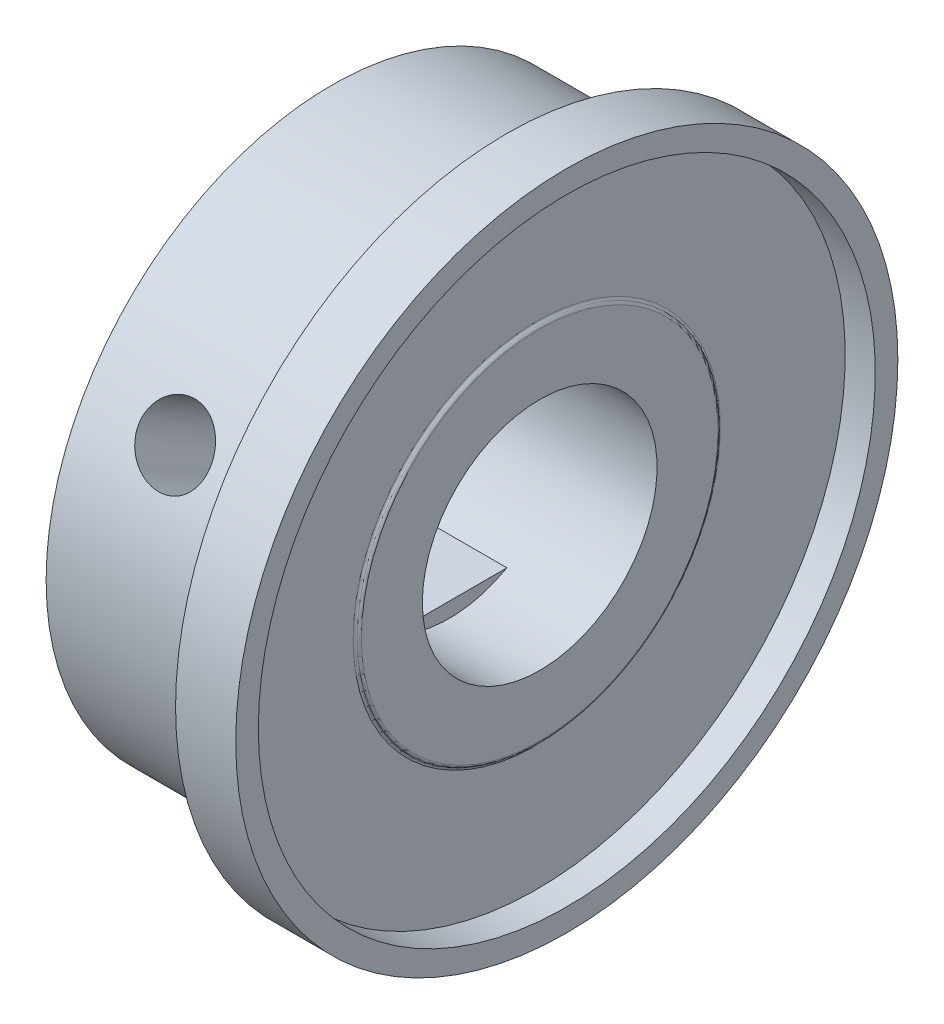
ISO-10303-21;
HEADER;
FILE_DESCRIPTION(('STEP AP214'),'2;1');
FILE_NAME('part.step','',(''),(''),'','','');
FILE_SCHEMA(('AUTOMOTIVE_DESIGN { 1 0 10303 214 1 1 1 1 }'));
ENDSEC;
DATA;
#1=APPLICATION_CONTEXT('core data for automotive mechanical design processes');
#2=APPLICATION_PROTOCOL_DEFINITION('international standard','automotive_design',2000,#1);
#3=PRODUCT_CONTEXT('',#1,'mechanical');
#4=PRODUCT('Part','Part','',(#3));
#5=PRODUCT_RELATED_PRODUCT_CATEGORY('part','',(#4));
#6=PRODUCT_DEFINITION_FORMATION('','',#4);
#7=PRODUCT_DEFINITION_CONTEXT('part definition',#1,'design');
#8=PRODUCT_DEFINITION('design','',#6,#7);
#9=PRODUCT_DEFINITION_SHAPE('','',#8);
#10=(LENGTH_UNIT() NAMED_UNIT(*) SI_UNIT(.MILLI.,.METRE.));
#11=(NAMED_UNIT(*) PLANE_ANGLE_UNIT() SI_UNIT($,.RADIAN.));
#12=(NAMED_UNIT(*) SI_UNIT($,.STERADIAN.) SOLID_ANGLE_UNIT());
#13=UNCERTAINTY_MEASURE_WITH_UNIT(LENGTH_MEASURE(1.E-05),#10,'distance_accuracy_value','');
#14=(GEOMETRIC_REPRESENTATION_CONTEXT(3) GLOBAL_UNCERTAINTY_ASSIGNED_CONTEXT((#13)) GLOBAL_UNIT_ASSIGNED_CONTEXT((#10,
#11,#12)) REPRESENTATION_CONTEXT('',''));
#15=CARTESIAN_POINT('',(0.,0.,0.));
#16=DIRECTION('',(0.,0.,1.));
#17=DIRECTION('',(1.,0.,0.));
#18=AXIS2_PLACEMENT_3D('',#15,#16,#17);
#19=CARTESIAN_POINT('',(-3.56436782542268,0.,0.));
#20=DIRECTION('',(-1.,0.,0.));
#21=DIRECTION('',(0.,0.,1.));
#22=AXIS2_PLACEMENT_3D('',#19,#20,#21);
#23=CYLINDRICAL_SURFACE('',#22,3.9);
#24=CARTESIAN_POINT('',(6.9,0.,0.));
#25=DIRECTION('',(-1.,0.,0.));
#26=DIRECTION('',(0.,0.,1.));
#27=AXIS2_PLACEMENT_3D('',#24,#25,#26);
#28=CIRCLE('',#27,3.9);
#29=CARTESIAN_POINT('',(6.9,0.,3.9));
#30=VERTEX_POINT('',#29);
#31=EDGE_CURVE('E418',#30,#30,#28,.T.);
#32=ORIENTED_EDGE('',*,*,#31,.F.);
#33=EDGE_LOOP('',(#32));
#34=FACE_BOUND('',#33,.T.);
#35=CARTESIAN_POINT('',(0.4,0.,0.));
#36=DIRECTION('',(-1.,0.,0.));
#37=DIRECTION('',(0.,0.,1.));
#38=AXIS2_PLACEMENT_3D('',#35,#36,#37);
#39=CIRCLE('',#38,3.9);
#40=CARTESIAN_POINT('',(0.4,-3.4,-1.91049731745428));
#41=VERTEX_POINT('',#40);
#42=CARTESIAN_POINT('',(0.4,3.4,-1.91049731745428));
#43=VERTEX_POINT('',#42);
#44=EDGE_CURVE('E365',#41,#43,#39,.F.);
#45=ORIENTED_EDGE('',*,*,#44,.F.);
#46=DIRECTION('',(-1.,0.,0.));
#47=VECTOR('',#46,1.);
#48=CARTESIAN_POINT('',(7.8,-3.4,-1.91049731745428));
#49=LINE('',#48,#47);
#50=CARTESIAN_POINT('',(3.9,-3.4,-1.91049731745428));
#51=VERTEX_POINT('',#50);
#52=EDGE_CURVE('E411',#51,#41,#49,.T.);
#53=ORIENTED_EDGE('',*,*,#52,.F.);
#54=CARTESIAN_POINT('',(3.9,0.,0.));
#55=DIRECTION('',(-1.,0.,0.));
#56=DIRECTION('',(0.,0.,1.));
#57=AXIS2_PLACEMENT_3D('',#54,#55,#56);
#58=CIRCLE('',#57,3.9);
#59=CARTESIAN_POINT('',(3.9,-3.4,1.91049731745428));
#60=VERTEX_POINT('',#59);
#61=EDGE_CURVE('E419',#51,#60,#58,.T.);
#62=ORIENTED_EDGE('',*,*,#61,.T.);
#63=DIRECTION('',(-1.,0.,0.));
#64=VECTOR('',#63,1.);
#65=CARTESIAN_POINT('',(7.8,-3.4,1.91049731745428));
#66=LINE('',#65,#64);
#67=CARTESIAN_POINT('',(0.4,-3.4,1.91049731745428));
#68=VERTEX_POINT('',#67);
#69=EDGE_CURVE('E404',#60,#68,#66,.T.);
#70=ORIENTED_EDGE('',*,*,#69,.T.);
#71=CARTESIAN_POINT('',(0.4,3.4,1.91049731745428));
#72=VERTEX_POINT('',#71);
#73=EDGE_CURVE('E391',#72,#68,#39,.F.);
#74=ORIENTED_EDGE('',*,*,#73,.F.);
#75=DIRECTION('',(-1.,0.,0.));
#76=VECTOR('',#75,1.);
#77=CARTESIAN_POINT('',(7.8,3.4,1.91049731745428));
#78=LINE('',#77,#76);
#79=CARTESIAN_POINT('',(3.9,3.4,1.91049731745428));
#80=VERTEX_POINT('',#79);
#81=EDGE_CURVE('E401',#80,#72,#78,.T.);
#82=ORIENTED_EDGE('',*,*,#81,.F.);
#83=CARTESIAN_POINT('',(3.9,3.4,-1.91049731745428));
#84=VERTEX_POINT('',#83);
#85=EDGE_CURVE('E416',#80,#84,#58,.T.);
#86=ORIENTED_EDGE('',*,*,#85,.T.);
#87=DIRECTION('',(-1.,0.,0.));
#88=VECTOR('',#87,1.);
#89=CARTESIAN_POINT('',(7.8,3.4,-1.91049731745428));
#90=LINE('',#89,#88);
#91=EDGE_CURVE('E372',#84,#43,#90,.T.);
#92=ORIENTED_EDGE('',*,*,#91,.T.);
#93=EDGE_LOOP('',(#45,#53,#62,#70,#74,#82,#86,#92));
#94=FACE_BOUND('',#93,.T.);
#95=ADVANCED_FACE('F350',(#34,#94),#23,.F.);
#96=CARTESIAN_POINT('',(7.8,-3.4,-1.91049731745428));
#97=DIRECTION('',(0.,-1.,0.));
#98=DIRECTION('',(0.,0.,-1.));
#99=AXIS2_PLACEMENT_3D('',#96,#97,#98);
#100=PLANE('',#99);
#101=DIRECTION('',(0.,0.,-1.));
#102=VECTOR('',#101,1.);
#103=CARTESIAN_POINT('',(0.4,-3.4,-1.91049731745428));
#104=LINE('',#103,#102);
#105=EDGE_CURVE('E409',#68,#41,#104,.T.);
#106=ORIENTED_EDGE('',*,*,#105,.F.);
#107=ORIENTED_EDGE('',*,*,#69,.F.);
#108=DIRECTION('',(0.,0.,1.));
#109=VECTOR('',#108,1.);
#110=CARTESIAN_POINT('',(3.9,-3.4,0.));
#111=LINE('',#110,#109);
#112=EDGE_CURVE('E395',#51,#60,#111,.T.);
#113=ORIENTED_EDGE('',*,*,#112,.F.);
#114=ORIENTED_EDGE('',*,*,#52,.T.);
#115=EDGE_LOOP('',(#106,#107,#113,#114));
#116=FACE_BOUND('',#115,.T.);
#117=ADVANCED_FACE('F470',(#116),#100,.F.);
#118=CARTESIAN_POINT('',(7.8,3.4,-1.91049731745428));
#119=DIRECTION('',(0.,1.,0.));
#120=DIRECTION('',(0.,0.,1.));
#121=AXIS2_PLACEMENT_3D('',#118,#119,#120);
#122=PLANE('',#121);
#123=DIRECTION('',(0.,0.,1.));
#124=VECTOR('',#123,1.);
#125=CARTESIAN_POINT('',(0.4,3.4,-1.91049731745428));
#126=LINE('',#125,#124);
#127=EDGE_CURVE('E388',#43,#72,#126,.T.);
#128=ORIENTED_EDGE('',*,*,#127,.F.);
#129=ORIENTED_EDGE('',*,*,#91,.F.);
#130=DIRECTION('',(0.,0.,-1.));
#131=VECTOR('',#130,1.);
#132=CARTESIAN_POINT('',(3.9,3.4,0.));
#133=LINE('',#132,#131);
#134=EDGE_CURVE('E408',#80,#84,#133,.T.);
#135=ORIENTED_EDGE('',*,*,#134,.F.);
#136=ORIENTED_EDGE('',*,*,#81,.T.);
#137=EDGE_LOOP('',(#128,#129,#135,#136));
#138=FACE_BOUND('',#137,.T.);
#139=ADVANCED_FACE('F407',(#138),#122,.F.);
#140=CARTESIAN_POINT('',(3.9,3.9,0.));
#141=DIRECTION('',(-1.,0.,0.));
#142=DIRECTION('',(0.,0.,1.));
#143=AXIS2_PLACEMENT_3D('',#140,#141,#142);
#144=PLANE('',#143);
#145=ORIENTED_EDGE('',*,*,#61,.F.);
#146=ORIENTED_EDGE('',*,*,#112,.T.);
#147=EDGE_LOOP('',(#145,#146));
#148=FACE_BOUND('',#147,.T.);
#149=ADVANCED_FACE('F476',(#148),#144,.F.);
#150=CARTESIAN_POINT('',(0.,0.,0.));
#151=DIRECTION('',(1.,0.,0.));
#152=DIRECTION('',(0.,0.,-1.));
#153=AXIS2_PLACEMENT_3D('',#150,#151,#152);
#154=PLANE('',#153);
#155=CARTESIAN_POINT('',(0.,0.,0.));
#156=DIRECTION('',(-1.,0.,0.));
#157=DIRECTION('',(0.,0.,1.));
#158=AXIS2_PLACEMENT_3D('',#155,#156,#157);
#159=CIRCLE('',#158,5.);
#160=CARTESIAN_POINT('',(0.,0.,5.));
#161=VERTEX_POINT('',#160);
#162=EDGE_CURVE('E449',#161,#161,#159,.T.);
#163=ORIENTED_EDGE('',*,*,#162,.F.);
#164=EDGE_LOOP('',(#163));
#165=FACE_BOUND('',#164,.T.);
#166=CARTESIAN_POINT('',(0.,0.,0.));
#167=DIRECTION('',(-1.,0.,0.));
#168=DIRECTION('',(0.,0.,1.));
#169=AXIS2_PLACEMENT_3D('',#166,#167,#168);
#170=CIRCLE('',#169,9.5);
#171=CARTESIAN_POINT('',(0.,0.,9.5));
#172=VERTEX_POINT('',#171);
#173=EDGE_CURVE('E437',#172,#172,#170,.T.);
#174=ORIENTED_EDGE('',*,*,#173,.T.);
#175=EDGE_LOOP('',(#174));
#176=FACE_BOUND('',#175,.T.);
#177=ADVANCED_FACE('F352',(#165,#176),#154,.F.);
#178=CARTESIAN_POINT('',(-3.56436782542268,0.,0.));
#179=DIRECTION('',(-1.,0.,0.));
#180=DIRECTION('',(0.,0.,1.));
#181=AXIS2_PLACEMENT_3D('',#178,#179,#180);
#182=CYLINDRICAL_SURFACE('',#181,9.5);
#183=CARTESIAN_POINT('',(3.,3.67272240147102,8.76134180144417));
#184=CARTESIAN_POINT('',(2.93288458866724,3.67272535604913,8.76134121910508));
#185=CARTESIAN_POINT('',(2.86572737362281,3.67797745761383,8.75914462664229));
#186=CARTESIAN_POINT('',(2.73328235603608,3.69881584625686,8.75036480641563));
#187=CARTESIAN_POINT('',(2.66799657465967,3.71441289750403,8.74377700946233));
#188=CARTESIAN_POINT('',(2.54123116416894,3.75538467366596,8.72625802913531));
#189=CARTESIAN_POINT('',(2.47974896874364,3.78075272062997,8.71532981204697));
#190=CARTESIAN_POINT('',(2.36227222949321,3.84039668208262,8.68921217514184));
#191=CARTESIAN_POINT('',(2.30627675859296,3.87467108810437,8.67402347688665));
#192=CARTESIAN_POINT('',(2.20103179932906,3.95119720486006,8.63943329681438));
#193=CARTESIAN_POINT('',(2.15181818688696,3.99348872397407,8.62001071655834));
#194=CARTESIAN_POINT('',(2.06184388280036,4.08457499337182,8.57722413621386));
#195=CARTESIAN_POINT('',(2.02108361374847,4.1333700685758,8.55385993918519));
#196=CARTESIAN_POINT('',(1.94904416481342,4.23610669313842,8.50345106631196));
#197=CARTESIAN_POINT('',(1.91779748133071,4.29006507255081,8.47639422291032));
#198=CARTESIAN_POINT('',(1.86588034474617,4.40131498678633,8.41916473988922));
#199=CARTESIAN_POINT('',(1.84520949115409,4.4586063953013,8.38899221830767));
#200=CARTESIAN_POINT('',(1.81513805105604,4.57446644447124,8.32637781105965));
#201=CARTESIAN_POINT('',(1.80567779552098,4.63302661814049,8.29394892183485));
#202=CARTESIAN_POINT('',(1.7981111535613,4.74998903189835,8.22752248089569));
#203=CARTESIAN_POINT('',(1.80000431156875,4.80839127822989,8.1935249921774));
#204=CARTESIAN_POINT('',(1.81504297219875,4.92304140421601,8.12515197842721));
#205=CARTESIAN_POINT('',(1.82812430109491,4.97929966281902,8.09077971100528));
#206=CARTESIAN_POINT('',(1.86506763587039,5.08849258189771,8.02255511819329));
#207=CARTESIAN_POINT('',(1.88892985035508,5.14142717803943,7.98870280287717));
#208=CARTESIAN_POINT('',(1.9468257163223,5.24275477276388,7.92257512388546));
#209=CARTESIAN_POINT('',(1.98088710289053,5.29113490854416,7.89030434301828));
#210=CARTESIAN_POINT('',(2.058194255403,5.38201017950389,7.82860064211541));
#211=CARTESIAN_POINT('',(2.10144045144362,5.42450503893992,7.79916785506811));
#212=CARTESIAN_POINT('',(2.19624895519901,5.50288969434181,7.74406361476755));
#213=CARTESIAN_POINT('',(2.24786719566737,5.53873132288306,7.7184198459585));
#214=CARTESIAN_POINT('',(2.3577624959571,5.60261343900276,7.67217588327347));
#215=CARTESIAN_POINT('',(2.41603957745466,5.63065390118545,7.65157570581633));
#216=CARTESIAN_POINT('',(2.53764819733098,5.67830271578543,7.61628269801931));
#217=CARTESIAN_POINT('',(2.60098194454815,5.69790735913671,7.6015924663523));
#218=CARTESIAN_POINT('',(2.73088008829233,5.7282127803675,7.57878231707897));
#219=CARTESIAN_POINT('',(2.7974443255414,5.73891399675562,7.57066207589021));
#220=CARTESIAN_POINT('',(2.93142308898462,5.75112188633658,7.56139249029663));
#221=CARTESIAN_POINT('',(2.99882860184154,5.75269137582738,7.56019552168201));
#222=CARTESIAN_POINT('',(3.13300665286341,5.7467677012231,7.56469921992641));
#223=CARTESIAN_POINT('',(3.19977920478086,5.73927473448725,7.57039973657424));
#224=CARTESIAN_POINT('',(3.33056113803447,5.7154412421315,7.5884089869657));
#225=CARTESIAN_POINT('',(3.39457925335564,5.69913131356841,7.60069486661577));
#226=CARTESIAN_POINT('',(3.51830841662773,5.65805415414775,7.63132201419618));
#227=CARTESIAN_POINT('',(3.57801931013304,5.63328662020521,7.64966349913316));
#228=CARTESIAN_POINT('',(3.69179275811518,5.57569520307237,7.69174212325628));
#229=CARTESIAN_POINT('',(3.74582313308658,5.54282861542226,7.71550781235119));
#230=CARTESIAN_POINT('',(3.8463733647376,5.46985463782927,7.7674120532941));
#231=CARTESIAN_POINT('',(3.89289292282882,5.42974696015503,7.79555077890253));
#232=CARTESIAN_POINT('',(3.97737604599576,5.34296657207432,7.85528444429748));
#233=CARTESIAN_POINT('',(4.01528819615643,5.29625698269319,7.88689856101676));
#234=CARTESIAN_POINT('',(4.08112443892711,5.19759012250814,7.95226722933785));
#235=CARTESIAN_POINT('',(4.10904873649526,5.14563295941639,7.98602173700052));
#236=CARTESIAN_POINT('',(4.15403183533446,5.03795216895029,8.05438330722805));
#237=CARTESIAN_POINT('',(4.17112027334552,4.98223928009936,8.08898777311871));
#238=CARTESIAN_POINT('',(4.19404296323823,4.86842484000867,8.1579939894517));
#239=CARTESIAN_POINT('',(4.19987773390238,4.81032339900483,8.19239574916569));
#240=CARTESIAN_POINT('',(4.2001176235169,4.69378433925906,8.25971464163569));
#241=CARTESIAN_POINT('',(4.1946019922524,4.6353518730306,8.29264043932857));
#242=CARTESIAN_POINT('',(4.17246559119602,4.51944480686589,8.3563744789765));
#243=CARTESIAN_POINT('',(4.15584483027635,4.4619702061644,8.3871827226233));
#244=CARTESIAN_POINT('',(4.11199501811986,4.34970567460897,8.4459503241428));
#245=CARTESIAN_POINT('',(4.08476984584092,4.2949147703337,8.47391071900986));
#246=CARTESIAN_POINT('',(4.02049224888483,4.18964742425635,8.52644822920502));
#247=CARTESIAN_POINT('',(3.98343969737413,4.13917103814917,8.55102530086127));
#248=CARTESIAN_POINT('',(3.90026621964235,4.043763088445,8.59655730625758));
#249=CARTESIAN_POINT('',(3.85408634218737,3.99887083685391,8.61748693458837));
#250=CARTESIAN_POINT('',(3.75409166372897,3.91644750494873,8.65525852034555));
#251=CARTESIAN_POINT('',(3.70027505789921,3.87891816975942,8.6720995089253));
#252=CARTESIAN_POINT('',(3.58629085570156,3.81233467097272,8.70157683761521));
#253=CARTESIAN_POINT('',(3.52609905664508,3.78331450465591,8.71419633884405));
#254=CARTESIAN_POINT('',(3.40127783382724,3.73496840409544,8.73502777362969));
#255=CARTESIAN_POINT('',(3.33665331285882,3.71563194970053,8.74324449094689));
#256=CARTESIAN_POINT('',(3.22641363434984,3.69193258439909,8.75326997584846));
#257=CARTESIAN_POINT('',(3.18149318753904,3.68474089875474,8.75629556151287));
#258=CARTESIAN_POINT('',(3.0910549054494,3.675134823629,8.76033166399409));
#259=CARTESIAN_POINT('',(3.04553707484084,3.67272039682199,8.76134219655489));
#260=CARTESIAN_POINT('',(3.,3.67272240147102,8.76134180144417));
#261=B_SPLINE_CURVE_WITH_KNOTS('',3,(#183,#184,#185,#186,#187,#188,#189,#190,#191,#192,#193,
#194,#195,#196,#197,#198,#199,#200,#201,#202,#203,#204,#205,#206,#207,#208,#209,#210,#211,#212,
#213,#214,#215,#216,#217,#218,#219,#220,#221,#222,#223,#224,#225,#226,#227,#228,#229,#230,#231,
#232,#233,#234,#235,#236,#237,#238,#239,#240,#241,#242,#243,#244,#245,#246,#247,#248,#249,#250,
#251,#252,#253,#254,#255,#256,#257,#258,#259,#260),.UNSPECIFIED.,.T.,.F.,(4,2,2,2,2,2,2,2,2,2,2,
2,2,2,2,2,2,2,2,2,2,2,2,2,2,2,2,2,2,2,2,2,2,2,2,2,2,2,4),(0.,0.201179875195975,
0.402569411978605,0.603821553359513,0.805039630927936,1.00728433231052,1.20953914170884,
1.41247725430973,1.61540768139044,1.81725307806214,2.01909037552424,2.21977766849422,
2.42046884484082,2.62171080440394,2.82296218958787,3.02561813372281,3.22827473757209,
3.43102035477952,3.63375598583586,3.83509535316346,4.03643033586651,4.23707107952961,
4.43771901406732,4.63944844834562,4.84118590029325,5.04409842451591,5.24700678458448,
5.44935775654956,5.65169940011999,5.85263306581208,6.05356657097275,6.25442664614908,
6.45528931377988,6.65749439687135,6.85974734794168,7.06279769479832,7.26562697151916,
7.40212638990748,7.53862474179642),.UNSPECIFIED.);
#262=CARTESIAN_POINT('',(3.,3.67272240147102,8.76134180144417));
#263=VERTEX_POINT('',#262);
#264=EDGE_CURVE('E443',#263,#263,#261,.T.);
#265=ORIENTED_EDGE('',*,*,#264,.T.);
#266=EDGE_LOOP('',(#265));
#267=FACE_BOUND('',#266,.T.);
#268=ORIENTED_EDGE('',*,*,#173,.F.);
#269=EDGE_LOOP('',(#268));
#270=FACE_BOUND('',#269,.T.);
#271=CARTESIAN_POINT('',(5.8,0.,0.));
#272=DIRECTION('',(-1.,0.,0.));
#273=DIRECTION('',(0.,0.,1.));
#274=AXIS2_PLACEMENT_3D('',#271,#272,#273);
#275=CIRCLE('',#274,9.5);
#276=CARTESIAN_POINT('',(5.8,0.,9.5));
#277=VERTEX_POINT('',#276);
#278=EDGE_CURVE('E434',#277,#277,#275,.T.);
#279=ORIENTED_EDGE('',*,*,#278,.T.);
#280=EDGE_LOOP('',(#279));
#281=FACE_BOUND('',#280,.T.);
#282=ADVANCED_FACE('F451',(#267,#270,#281),#182,.T.);
#283=CARTESIAN_POINT('',(5.8,9.5,0.));
#284=DIRECTION('',(1.,0.,0.));
#285=DIRECTION('',(0.,0.,-1.));
#286=AXIS2_PLACEMENT_3D('',#283,#284,#285);
#287=PLANE('',#286);
#288=ORIENTED_EDGE('',*,*,#278,.F.);
#289=EDGE_LOOP('',(#288));
#290=FACE_BOUND('',#289,.T.);
#291=CARTESIAN_POINT('',(5.8,0.,0.));
#292=DIRECTION('',(-1.,0.,0.));
#293=DIRECTION('',(0.,0.,1.));
#294=AXIS2_PLACEMENT_3D('',#291,#292,#293);
#295=CIRCLE('',#294,11.);
#296=CARTESIAN_POINT('',(5.8,0.,11.));
#297=VERTEX_POINT('',#296);
#298=EDGE_CURVE('E431',#297,#297,#295,.T.);
#299=ORIENTED_EDGE('',*,*,#298,.T.);
#300=EDGE_LOOP('',(#299));
#301=FACE_BOUND('',#300,.T.);
#302=ADVANCED_FACE('F501',(#290,#301),#287,.F.);
#303=CARTESIAN_POINT('',(-3.56436782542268,0.,0.));
#304=DIRECTION('',(-1.,0.,0.));
#305=DIRECTION('',(0.,0.,1.));
#306=AXIS2_PLACEMENT_3D('',#303,#304,#305);
#307=CYLINDRICAL_SURFACE('',#306,11.);
#308=ORIENTED_EDGE('',*,*,#298,.F.);
#309=EDGE_LOOP('',(#308));
#310=FACE_BOUND('',#309,.T.);
#311=CARTESIAN_POINT('',(7.8,0.,0.));
#312=DIRECTION('',(-1.,0.,0.));
#313=DIRECTION('',(0.,0.,1.));
#314=AXIS2_PLACEMENT_3D('',#311,#312,#313);
#315=CIRCLE('',#314,11.);
#316=CARTESIAN_POINT('',(7.8,0.,11.));
#317=VERTEX_POINT('',#316);
#318=EDGE_CURVE('E428',#317,#317,#315,.T.);
#319=ORIENTED_EDGE('',*,*,#318,.T.);
#320=EDGE_LOOP('',(#319));
#321=FACE_BOUND('',#320,.T.);
#322=ADVANCED_FACE('F498',(#310,#321),#307,.T.);
#323=CARTESIAN_POINT('',(7.8,11.,0.));
#324=DIRECTION('',(-1.,0.,0.));
#325=DIRECTION('',(0.,0.,1.));
#326=AXIS2_PLACEMENT_3D('',#323,#324,#325);
#327=PLANE('',#326);
#328=ORIENTED_EDGE('',*,*,#318,.F.);
#329=EDGE_LOOP('',(#328));
#330=FACE_BOUND('',#329,.T.);
#331=CARTESIAN_POINT('',(7.8,0.,0.));
#332=DIRECTION('',(-1.,0.,0.));
#333=DIRECTION('',(0.,0.,1.));
#334=AXIS2_PLACEMENT_3D('',#331,#332,#333);
#335=CIRCLE('',#334,10.25);
#336=CARTESIAN_POINT('',(7.8,0.,10.25));
#337=VERTEX_POINT('',#336);
#338=EDGE_CURVE('E425',#337,#337,#335,.T.);
#339=ORIENTED_EDGE('',*,*,#338,.T.);
#340=EDGE_LOOP('',(#339));
#341=FACE_BOUND('',#340,.T.);
#342=ADVANCED_FACE('F494',(#330,#341),#327,.F.);
#343=CARTESIAN_POINT('',(-3.56436782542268,0.,0.));
#344=DIRECTION('',(-1.,0.,0.));
#345=DIRECTION('',(0.,0.,1.));
#346=AXIS2_PLACEMENT_3D('',#343,#344,#345);
#347=CYLINDRICAL_SURFACE('',#346,10.25);
#348=ORIENTED_EDGE('',*,*,#338,.F.);
#349=EDGE_LOOP('',(#348));
#350=FACE_BOUND('',#349,.T.);
#351=CARTESIAN_POINT('',(6.8,0.,0.));
#352=DIRECTION('',(-1.,0.,0.));
#353=DIRECTION('',(0.,0.,1.));
#354=AXIS2_PLACEMENT_3D('',#351,#352,#353);
#355=CIRCLE('',#354,10.25);
#356=CARTESIAN_POINT('',(6.8,0.,10.25));
#357=VERTEX_POINT('',#356);
#358=EDGE_CURVE('E422',#357,#357,#355,.T.);
#359=ORIENTED_EDGE('',*,*,#358,.T.);
#360=EDGE_LOOP('',(#359));
#361=FACE_BOUND('',#360,.T.);
#362=ADVANCED_FACE('F490',(#350,#361),#347,.F.);
#363=CARTESIAN_POINT('',(6.8,10.25,0.));
#364=DIRECTION('',(-1.,0.,0.));
#365=DIRECTION('',(0.,0.,1.));
#366=AXIS2_PLACEMENT_3D('',#363,#364,#365);
#367=PLANE('',#366);
#368=CARTESIAN_POINT('',(6.8,0.,0.));
#369=DIRECTION('',(-1.,0.,0.));
#370=DIRECTION('',(0.,0.,1.));
#371=AXIS2_PLACEMENT_3D('',#368,#369,#370);
#372=CIRCLE('',#371,6.1);
#373=CARTESIAN_POINT('',(6.8,0.,6.1));
#374=VERTEX_POINT('',#373);
#375=EDGE_CURVE('E394',#374,#374,#372,.T.);
#376=ORIENTED_EDGE('',*,*,#375,.T.);
#377=EDGE_LOOP('',(#376));
#378=FACE_BOUND('',#377,.T.);
#379=ORIENTED_EDGE('',*,*,#358,.F.);
#380=EDGE_LOOP('',(#379));
#381=FACE_BOUND('',#380,.T.);
#382=ADVANCED_FACE('F486',(#378,#381),#367,.F.);
#383=CARTESIAN_POINT('',(6.9,6.,0.));
#384=DIRECTION('',(-1.,0.,0.));
#385=DIRECTION('',(0.,0.,1.));
#386=AXIS2_PLACEMENT_3D('',#383,#384,#385);
#387=PLANE('',#386);
#388=CARTESIAN_POINT('',(6.9,0.,0.));
#389=DIRECTION('',(-1.,0.,0.));
#390=DIRECTION('',(0.,0.,1.));
#391=AXIS2_PLACEMENT_3D('',#388,#389,#390);
#392=CIRCLE('',#391,5.92679491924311);
#393=CARTESIAN_POINT('',(6.9,0.,5.92679491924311));
#394=VERTEX_POINT('',#393);
#395=EDGE_CURVE('E11',#394,#394,#392,.F.);
#396=ORIENTED_EDGE('',*,*,#395,.T.);
#397=EDGE_LOOP('',(#396));
#398=FACE_BOUND('',#397,.T.);
#399=ORIENTED_EDGE('',*,*,#31,.T.);
#400=EDGE_LOOP('',(#399));
#401=FACE_BOUND('',#400,.T.);
#402=ADVANCED_FACE('F479',(#398,#401),#387,.F.);
#403=ORIENTED_EDGE('',*,*,#85,.F.);
#404=ORIENTED_EDGE('',*,*,#134,.T.);
#405=EDGE_LOOP('',(#403,#404));
#406=FACE_BOUND('',#405,.T.);
#407=ADVANCED_FACE('F465',(#406),#144,.F.);
#408=CARTESIAN_POINT('',(0.4,0.,0.));
#409=DIRECTION('',(-1.,0.,0.));
#410=DIRECTION('',(0.,0.,1.));
#411=AXIS2_PLACEMENT_3D('',#408,#409,#410);
#412=PLANE('',#411);
#413=CARTESIAN_POINT('',(0.4,0.,0.));
#414=DIRECTION('',(-1.,0.,0.));
#415=DIRECTION('',(0.,0.,1.));
#416=AXIS2_PLACEMENT_3D('',#413,#414,#415);
#417=CIRCLE('',#416,5.);
#418=CARTESIAN_POINT('',(0.4,0.,5.));
#419=VERTEX_POINT('',#418);
#420=EDGE_CURVE('E405',#419,#419,#417,.T.);
#421=ORIENTED_EDGE('',*,*,#420,.T.);
#422=EDGE_LOOP('',(#421));
#423=FACE_BOUND('',#422,.T.);
#424=ORIENTED_EDGE('',*,*,#105,.T.);
#425=ORIENTED_EDGE('',*,*,#44,.T.);
#426=ORIENTED_EDGE('',*,*,#127,.T.);
#427=ORIENTED_EDGE('',*,*,#73,.T.);
#428=EDGE_LOOP('',(#424,#425,#426,#427));
#429=FACE_BOUND('',#428,.T.);
#430=ADVANCED_FACE('F390',(#423,#429),#412,.T.);
#431=CARTESIAN_POINT('',(0.4,0.,0.));
#432=DIRECTION('',(-1.,0.,0.));
#433=DIRECTION('',(0.,0.,1.));
#434=AXIS2_PLACEMENT_3D('',#431,#432,#433);
#435=CYLINDRICAL_SURFACE('',#434,5.);
#436=ORIENTED_EDGE('',*,*,#420,.F.);
#437=EDGE_LOOP('',(#436));
#438=FACE_BOUND('',#437,.T.);
#439=ORIENTED_EDGE('',*,*,#162,.T.);
#440=EDGE_LOOP('',(#439));
#441=FACE_BOUND('',#440,.T.);
#442=ADVANCED_FACE('F460',(#438,#441),#435,.F.);
#443=CARTESIAN_POINT('',(3.,2.00000000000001,3.46410161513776));
#444=DIRECTION('',(0.,0.500000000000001,0.866025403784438));
#445=DIRECTION('',(0.,-0.866025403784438,0.500000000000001));
#446=AXIS2_PLACEMENT_3D('',#443,#444,#445);
#447=CYLINDRICAL_SURFACE('',#446,1.2);
#448=CARTESIAN_POINT('',(3.,2.00000000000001,3.46410161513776));
#449=DIRECTION('',(0.,0.500000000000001,0.866025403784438));
#450=DIRECTION('',(0.,-0.866025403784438,0.500000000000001));
#451=AXIS2_PLACEMENT_3D('',#448,#449,#450);
#452=CIRCLE('',#451,1.2);
#453=CARTESIAN_POINT('',(3.,0.96076951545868,4.06410161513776));
#454=VERTEX_POINT('',#453);
#455=EDGE_CURVE('E450',#454,#454,#452,.T.);
#456=ORIENTED_EDGE('',*,*,#455,.F.);
#457=EDGE_LOOP('',(#456));
#458=FACE_BOUND('',#457,.T.);
#459=ORIENTED_EDGE('',*,*,#264,.F.);
#460=EDGE_LOOP('',(#459));
#461=FACE_BOUND('',#460,.T.);
#462=ADVANCED_FACE('F454',(#458,#461),#447,.F.);
#463=CARTESIAN_POINT('',(3.,2.00000000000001,3.46410161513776));
#464=DIRECTION('',(0.,0.500000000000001,0.866025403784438));
#465=DIRECTION('',(0.,-0.866025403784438,0.500000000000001));
#466=AXIS2_PLACEMENT_3D('',#463,#464,#465);
#467=PLANE('',#466);
#468=ORIENTED_EDGE('',*,*,#455,.T.);
#469=EDGE_LOOP('',(#468));
#470=FACE_BOUND('',#469,.T.);
#471=ADVANCED_FACE('F459',(#470),#467,.T.);
#472=CARTESIAN_POINT('',(6.9,0.,0.));
#473=DIRECTION('',(-1.,0.,0.));
#474=DIRECTION('',(0.,0.,1.));
#475=AXIS2_PLACEMENT_3D('',#472,#473,#474);
#476=TOROIDAL_SURFACE('',#475,6.1,0.1);
#477=CARTESIAN_POINT('',(6.84999999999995,0.,0.));
#478=DIRECTION('',(1.,0.,0.));
#479=DIRECTION('',(0.,0.,-1.));
#480=AXIS2_PLACEMENT_3D('',#477,#478,#479);
#481=CIRCLE('',#480,6.01339745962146);
#482=CARTESIAN_POINT('',(6.84999999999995,0.,-6.01339745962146));
#483=VERTEX_POINT('',#482);
#484=EDGE_CURVE('E358',#483,#483,#481,.F.);
#485=ORIENTED_EDGE('',*,*,#484,.T.);
#486=EDGE_LOOP('',(#485));
#487=FACE_BOUND('',#486,.T.);
#488=ORIENTED_EDGE('',*,*,#375,.F.);
#489=EDGE_LOOP('',(#488));
#490=FACE_BOUND('',#489,.T.);
#491=ADVANCED_FACE('F548',(#487,#490),#476,.F.);
#492=CARTESIAN_POINT('',(6.8,0.,0.));
#493=DIRECTION('',(1.,0.,0.));
#494=DIRECTION('',(0.,0.,-1.));
#495=AXIS2_PLACEMENT_3D('',#492,#493,#494);
#496=TOROIDAL_SURFACE('',#495,5.92679491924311,0.1);
#497=ORIENTED_EDGE('',*,*,#395,.F.);
#498=EDGE_LOOP('',(#497));
#499=FACE_BOUND('',#498,.T.);
#500=ORIENTED_EDGE('',*,*,#484,.F.);
#501=EDGE_LOOP('',(#500));
#502=FACE_BOUND('',#501,.T.);
#503=ADVANCED_FACE('F552',(#499,#502),#496,.T.);
#504=CLOSED_SHELL('',(#95,#117,#139,#149,#177,#282,#302,#322,#342,#362,#382,#402,#407,#430,#442,
#462,#471,#491,#503));
#505=MANIFOLD_SOLID_BREP('B2',#504);
#506=ADVANCED_BREP_SHAPE_REPRESENTATION('',(#18,#505),#14);
#507=SHAPE_DEFINITION_REPRESENTATION(#9,#506);
ENDSEC;
END-ISO-10303-21;
